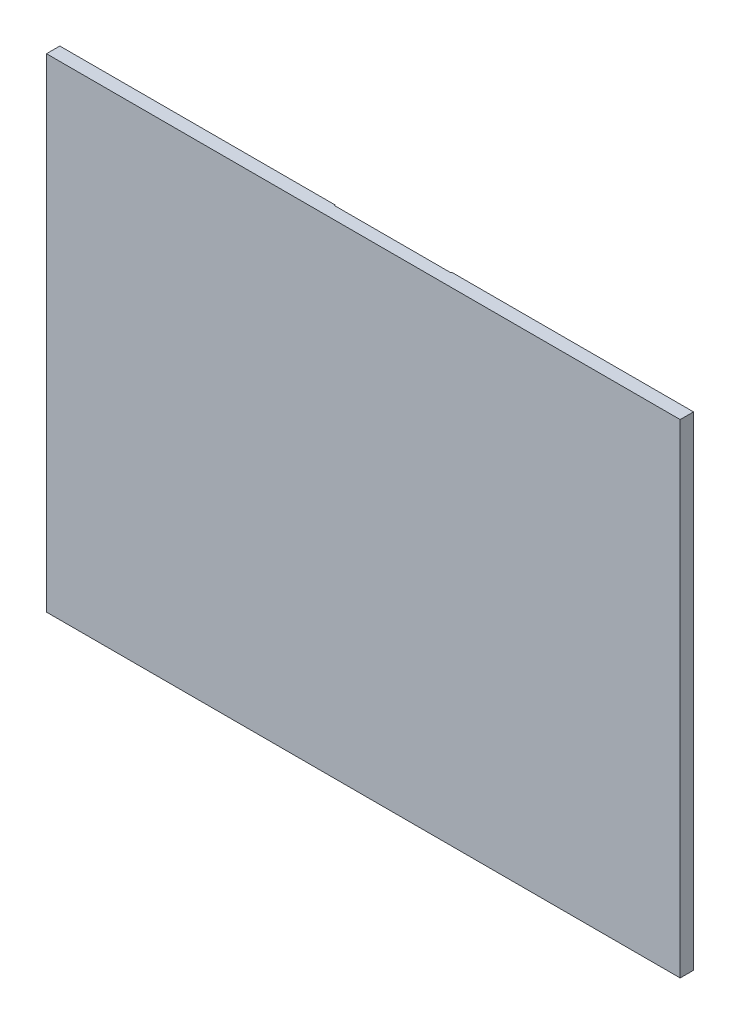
ISO-10303-21;
HEADER;
FILE_DESCRIPTION(('STEP AP214'),'2;1');
FILE_NAME('part.step','',(''),(''),'','','');
FILE_SCHEMA(('AUTOMOTIVE_DESIGN { 1 0 10303 214 1 1 1 1 }'));
ENDSEC;
DATA;
#1=APPLICATION_CONTEXT('core data for automotive mechanical design processes');
#2=APPLICATION_PROTOCOL_DEFINITION('international standard','automotive_design',2000,#1);
#3=PRODUCT_CONTEXT('',#1,'mechanical');
#4=PRODUCT('Part','Part','',(#3));
#5=PRODUCT_RELATED_PRODUCT_CATEGORY('part','',(#4));
#6=PRODUCT_DEFINITION_FORMATION('','',#4);
#7=PRODUCT_DEFINITION_CONTEXT('part definition',#1,'design');
#8=PRODUCT_DEFINITION('design','',#6,#7);
#9=PRODUCT_DEFINITION_SHAPE('','',#8);
#10=(LENGTH_UNIT() NAMED_UNIT(*) SI_UNIT(.MILLI.,.METRE.));
#11=(NAMED_UNIT(*) PLANE_ANGLE_UNIT() SI_UNIT($,.RADIAN.));
#12=(NAMED_UNIT(*) SI_UNIT($,.STERADIAN.) SOLID_ANGLE_UNIT());
#13=UNCERTAINTY_MEASURE_WITH_UNIT(LENGTH_MEASURE(1.E-05),#10,'distance_accuracy_value','');
#14=(GEOMETRIC_REPRESENTATION_CONTEXT(3) GLOBAL_UNCERTAINTY_ASSIGNED_CONTEXT((#13)) GLOBAL_UNIT_ASSIGNED_CONTEXT((#10,
#11,#12)) REPRESENTATION_CONTEXT('',''));
#15=CARTESIAN_POINT('',(0.,0.,0.));
#16=DIRECTION('',(0.,0.,1.));
#17=DIRECTION('',(1.,0.,0.));
#18=AXIS2_PLACEMENT_3D('',#15,#16,#17);
#19=CARTESIAN_POINT('',(-18.5,29.,0.));
#20=DIRECTION('',(0.,0.,-1.));
#21=DIRECTION('',(-1.,0.,0.));
#22=AXIS2_PLACEMENT_3D('',#19,#20,#21);
#23=PLANE('',#22);
#24=DIRECTION('',(0.,1.,0.));
#25=VECTOR('',#24,1.);
#26=CARTESIAN_POINT('',(14.5,29.,0.));
#27=LINE('',#26,#25);
#28=CARTESIAN_POINT('',(14.5,-29.,0.));
#29=VERTEX_POINT('',#28);
#30=CARTESIAN_POINT('',(14.5,29.,0.));
#31=VERTEX_POINT('',#30);
#32=EDGE_CURVE('E40',#29,#31,#27,.T.);
#33=ORIENTED_EDGE('',*,*,#32,.F.);
#34=DIRECTION('',(1.,0.,0.));
#35=VECTOR('',#34,1.);
#36=CARTESIAN_POINT('',(-18.5,-29.,0.));
#37=LINE('',#36,#35);
#38=CARTESIAN_POINT('',(-18.5,-29.,0.));
#39=VERTEX_POINT('',#38);
#40=EDGE_CURVE('E119',#39,#29,#37,.T.);
#41=ORIENTED_EDGE('',*,*,#40,.F.);
#42=DIRECTION('',(0.,-1.,0.));
#43=VECTOR('',#42,1.);
#44=CARTESIAN_POINT('',(-18.5,29.,0.));
#45=LINE('',#44,#43);
#46=CARTESIAN_POINT('',(-18.5,29.,0.));
#47=VERTEX_POINT('',#46);
#48=EDGE_CURVE('E120',#47,#39,#45,.T.);
#49=ORIENTED_EDGE('',*,*,#48,.F.);
#50=DIRECTION('',(-1.,0.,0.));
#51=VECTOR('',#50,1.);
#52=CARTESIAN_POINT('',(-18.5,29.,0.));
#53=LINE('',#52,#51);
#54=EDGE_CURVE('E157',#31,#47,#53,.T.);
#55=ORIENTED_EDGE('',*,*,#54,.F.);
#56=EDGE_LOOP('',(#33,#41,#49,#55));
#57=FACE_BOUND('',#56,.T.);
#58=ADVANCED_FACE('F32',(#57),#23,.T.);
#59=CARTESIAN_POINT('',(-18.5,29.,1.6));
#60=DIRECTION('',(0.,-1.,0.));
#61=DIRECTION('',(1.,0.,0.));
#62=AXIS2_PLACEMENT_3D('',#59,#60,#61);
#63=PLANE('',#62);
#64=DIRECTION('',(-1.,0.,0.));
#65=VECTOR('',#64,1.);
#66=CARTESIAN_POINT('',(-18.5,29.,0.1));
#67=LINE('',#66,#65);
#68=CARTESIAN_POINT('',(28.5,29.,0.1));
#69=VERTEX_POINT('',#68);
#70=CARTESIAN_POINT('',(14.5,29.,0.1));
#71=VERTEX_POINT('',#70);
#72=EDGE_CURVE('E159',#69,#71,#67,.T.);
#73=ORIENTED_EDGE('',*,*,#72,.T.);
#74=DIRECTION('',(0.,0.,-1.));
#75=VECTOR('',#74,1.);
#76=CARTESIAN_POINT('',(14.5,29.,1.6));
#77=LINE('',#76,#75);
#78=EDGE_CURVE('E148',#71,#31,#77,.T.);
#79=ORIENTED_EDGE('',*,*,#78,.T.);
#80=ORIENTED_EDGE('',*,*,#54,.T.);
#81=DIRECTION('',(0.,0.,-1.));
#82=VECTOR('',#81,1.);
#83=CARTESIAN_POINT('',(-18.5,29.,1.6));
#84=LINE('',#83,#82);
#85=CARTESIAN_POINT('',(-18.5,29.,1.6));
#86=VERTEX_POINT('',#85);
#87=EDGE_CURVE('E105',#86,#47,#84,.T.);
#88=ORIENTED_EDGE('',*,*,#87,.F.);
#89=DIRECTION('',(-1.,0.,0.));
#90=VECTOR('',#89,1.);
#91=CARTESIAN_POINT('',(-18.5,29.,1.6));
#92=LINE('',#91,#90);
#93=CARTESIAN_POINT('',(57.5,29.,1.6));
#94=VERTEX_POINT('',#93);
#95=EDGE_CURVE('E127',#94,#86,#92,.T.);
#96=ORIENTED_EDGE('',*,*,#95,.F.);
#97=DIRECTION('',(0.,0.,-1.));
#98=VECTOR('',#97,1.);
#99=CARTESIAN_POINT('',(57.5,29.,1.6));
#100=LINE('',#99,#98);
#101=CARTESIAN_POINT('',(57.5,29.,0.));
#102=VERTEX_POINT('',#101);
#103=EDGE_CURVE('E134',#94,#102,#100,.T.);
#104=ORIENTED_EDGE('',*,*,#103,.T.);
#105=CARTESIAN_POINT('',(28.5,29.,0.));
#106=VERTEX_POINT('',#105);
#107=EDGE_CURVE('E122',#102,#106,#53,.T.);
#108=ORIENTED_EDGE('',*,*,#107,.T.);
#109=DIRECTION('',(0.,0.,1.));
#110=VECTOR('',#109,1.);
#111=CARTESIAN_POINT('',(28.5,29.,1.6));
#112=LINE('',#111,#110);
#113=EDGE_CURVE('E47',#106,#69,#112,.T.);
#114=ORIENTED_EDGE('',*,*,#113,.T.);
#115=EDGE_LOOP('',(#73,#79,#80,#88,#96,#104,#108,#114));
#116=FACE_BOUND('',#115,.T.);
#117=ADVANCED_FACE('F34',(#116),#63,.F.);
#118=CARTESIAN_POINT('',(-18.5,29.,1.6));
#119=DIRECTION('',(1.,0.,0.));
#120=DIRECTION('',(0.,1.,0.));
#121=AXIS2_PLACEMENT_3D('',#118,#119,#120);
#122=PLANE('',#121);
#123=ORIENTED_EDGE('',*,*,#48,.T.);
#124=DIRECTION('',(0.,0.,-1.));
#125=VECTOR('',#124,1.);
#126=CARTESIAN_POINT('',(-18.5,-29.,1.6));
#127=LINE('',#126,#125);
#128=CARTESIAN_POINT('',(-18.5,-29.,1.6));
#129=VERTEX_POINT('',#128);
#130=EDGE_CURVE('E139',#129,#39,#127,.T.);
#131=ORIENTED_EDGE('',*,*,#130,.F.);
#132=DIRECTION('',(0.,-1.,0.));
#133=VECTOR('',#132,1.);
#134=CARTESIAN_POINT('',(-18.5,29.,1.6));
#135=LINE('',#134,#133);
#136=EDGE_CURVE('E129',#86,#129,#135,.T.);
#137=ORIENTED_EDGE('',*,*,#136,.F.);
#138=ORIENTED_EDGE('',*,*,#87,.T.);
#139=EDGE_LOOP('',(#123,#131,#137,#138));
#140=FACE_BOUND('',#139,.T.);
#141=ADVANCED_FACE('F176',(#140),#122,.F.);
#142=CARTESIAN_POINT('',(-18.5,-29.,1.6));
#143=DIRECTION('',(0.,1.,0.));
#144=DIRECTION('',(-1.,0.,0.));
#145=AXIS2_PLACEMENT_3D('',#142,#143,#144);
#146=PLANE('',#145);
#147=ORIENTED_EDGE('',*,*,#40,.T.);
#148=DIRECTION('',(0.,0.,1.));
#149=VECTOR('',#148,1.);
#150=CARTESIAN_POINT('',(14.5,-29.,1.6));
#151=LINE('',#150,#149);
#152=CARTESIAN_POINT('',(14.5,-29.,0.1));
#153=VERTEX_POINT('',#152);
#154=EDGE_CURVE('E150',#29,#153,#151,.T.);
#155=ORIENTED_EDGE('',*,*,#154,.T.);
#156=DIRECTION('',(1.,0.,0.));
#157=VECTOR('',#156,1.);
#158=CARTESIAN_POINT('',(-18.5,-29.,0.1));
#159=LINE('',#158,#157);
#160=CARTESIAN_POINT('',(28.5,-29.,0.1));
#161=VERTEX_POINT('',#160);
#162=EDGE_CURVE('E11',#153,#161,#159,.T.);
#163=ORIENTED_EDGE('',*,*,#162,.T.);
#164=DIRECTION('',(0.,0.,-1.));
#165=VECTOR('',#164,1.);
#166=CARTESIAN_POINT('',(28.5,-29.,1.6));
#167=LINE('',#166,#165);
#168=CARTESIAN_POINT('',(28.5,-29.,0.));
#169=VERTEX_POINT('',#168);
#170=EDGE_CURVE('E99',#161,#169,#167,.T.);
#171=ORIENTED_EDGE('',*,*,#170,.T.);
#172=CARTESIAN_POINT('',(57.5,-29.,0.));
#173=VERTEX_POINT('',#172);
#174=EDGE_CURVE('E111',#169,#173,#37,.T.);
#175=ORIENTED_EDGE('',*,*,#174,.T.);
#176=DIRECTION('',(0.,0.,-1.));
#177=VECTOR('',#176,1.);
#178=CARTESIAN_POINT('',(57.5,-29.,1.6));
#179=LINE('',#178,#177);
#180=CARTESIAN_POINT('',(57.5,-29.,1.6));
#181=VERTEX_POINT('',#180);
#182=EDGE_CURVE('E137',#181,#173,#179,.T.);
#183=ORIENTED_EDGE('',*,*,#182,.F.);
#184=DIRECTION('',(1.,0.,0.));
#185=VECTOR('',#184,1.);
#186=CARTESIAN_POINT('',(-18.5,-29.,1.6));
#187=LINE('',#186,#185);
#188=EDGE_CURVE('E131',#129,#181,#187,.T.);
#189=ORIENTED_EDGE('',*,*,#188,.F.);
#190=ORIENTED_EDGE('',*,*,#130,.T.);
#191=EDGE_LOOP('',(#147,#155,#163,#171,#175,#183,#189,#190));
#192=FACE_BOUND('',#191,.T.);
#193=ADVANCED_FACE('F109',(#192),#146,.F.);
#194=CARTESIAN_POINT('',(57.5,29.,1.6));
#195=DIRECTION('',(-1.,0.,0.));
#196=DIRECTION('',(0.,-1.,0.));
#197=AXIS2_PLACEMENT_3D('',#194,#195,#196);
#198=PLANE('',#197);
#199=DIRECTION('',(0.,1.,0.));
#200=VECTOR('',#199,1.);
#201=CARTESIAN_POINT('',(57.5,29.,0.));
#202=LINE('',#201,#200);
#203=EDGE_CURVE('E118',#173,#102,#202,.T.);
#204=ORIENTED_EDGE('',*,*,#203,.T.);
#205=ORIENTED_EDGE('',*,*,#103,.F.);
#206=DIRECTION('',(0.,1.,0.));
#207=VECTOR('',#206,1.);
#208=CARTESIAN_POINT('',(57.5,29.,1.6));
#209=LINE('',#208,#207);
#210=EDGE_CURVE('E55',#181,#94,#209,.T.);
#211=ORIENTED_EDGE('',*,*,#210,.F.);
#212=ORIENTED_EDGE('',*,*,#182,.T.);
#213=EDGE_LOOP('',(#204,#205,#211,#212));
#214=FACE_BOUND('',#213,.T.);
#215=ADVANCED_FACE('F171',(#214),#198,.F.);
#216=CARTESIAN_POINT('',(-18.5,29.,1.6));
#217=DIRECTION('',(0.,0.,-1.));
#218=DIRECTION('',(-1.,0.,0.));
#219=AXIS2_PLACEMENT_3D('',#216,#217,#218);
#220=PLANE('',#219);
#221=ORIENTED_EDGE('',*,*,#95,.T.);
#222=ORIENTED_EDGE('',*,*,#136,.T.);
#223=ORIENTED_EDGE('',*,*,#188,.T.);
#224=ORIENTED_EDGE('',*,*,#210,.T.);
#225=EDGE_LOOP('',(#221,#222,#223,#224));
#226=FACE_BOUND('',#225,.T.);
#227=ADVANCED_FACE('F174',(#226),#220,.F.);
#228=DIRECTION('',(0.,-1.,0.));
#229=VECTOR('',#228,1.);
#230=CARTESIAN_POINT('',(28.5,29.,0.));
#231=LINE('',#230,#229);
#232=EDGE_CURVE('E96',#106,#169,#231,.T.);
#233=ORIENTED_EDGE('',*,*,#232,.F.);
#234=ORIENTED_EDGE('',*,*,#107,.F.);
#235=ORIENTED_EDGE('',*,*,#203,.F.);
#236=ORIENTED_EDGE('',*,*,#174,.F.);
#237=EDGE_LOOP('',(#233,#234,#235,#236));
#238=FACE_BOUND('',#237,.T.);
#239=ADVANCED_FACE('F117',(#238),#23,.T.);
#240=CARTESIAN_POINT('',(14.5,31.6865626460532,0.1));
#241=DIRECTION('',(0.,0.,1.));
#242=DIRECTION('',(1.,0.,0.));
#243=AXIS2_PLACEMENT_3D('',#240,#241,#242);
#244=PLANE('',#243);
#245=DIRECTION('',(0.,-1.,0.));
#246=VECTOR('',#245,1.);
#247=CARTESIAN_POINT('',(28.5,31.6865626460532,0.1));
#248=LINE('',#247,#246);
#249=EDGE_CURVE('E166',#69,#161,#248,.T.);
#250=ORIENTED_EDGE('',*,*,#249,.T.);
#251=ORIENTED_EDGE('',*,*,#162,.F.);
#252=DIRECTION('',(0.,1.,0.));
#253=VECTOR('',#252,1.);
#254=CARTESIAN_POINT('',(14.5,31.6865626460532,0.1));
#255=LINE('',#254,#253);
#256=EDGE_CURVE('E114',#153,#71,#255,.T.);
#257=ORIENTED_EDGE('',*,*,#256,.T.);
#258=ORIENTED_EDGE('',*,*,#72,.F.);
#259=EDGE_LOOP('',(#250,#251,#257,#258));
#260=FACE_BOUND('',#259,.T.);
#261=ADVANCED_FACE('F168',(#260),#244,.F.);
#262=CARTESIAN_POINT('',(14.5,31.6865626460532,0.1));
#263=DIRECTION('',(-1.,0.,0.));
#264=DIRECTION('',(0.,-1.,0.));
#265=AXIS2_PLACEMENT_3D('',#262,#263,#264);
#266=PLANE('',#265);
#267=ORIENTED_EDGE('',*,*,#256,.F.);
#268=ORIENTED_EDGE('',*,*,#154,.F.);
#269=ORIENTED_EDGE('',*,*,#32,.T.);
#270=ORIENTED_EDGE('',*,*,#78,.F.);
#271=EDGE_LOOP('',(#267,#268,#269,#270));
#272=FACE_BOUND('',#271,.T.);
#273=ADVANCED_FACE('F147',(#272),#266,.F.);
#274=CARTESIAN_POINT('',(28.5,31.6865626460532,0.1));
#275=DIRECTION('',(1.,0.,0.));
#276=DIRECTION('',(0.,1.,0.));
#277=AXIS2_PLACEMENT_3D('',#274,#275,#276);
#278=PLANE('',#277);
#279=ORIENTED_EDGE('',*,*,#232,.T.);
#280=ORIENTED_EDGE('',*,*,#170,.F.);
#281=ORIENTED_EDGE('',*,*,#249,.F.);
#282=ORIENTED_EDGE('',*,*,#113,.F.);
#283=EDGE_LOOP('',(#279,#280,#281,#282));
#284=FACE_BOUND('',#283,.T.);
#285=ADVANCED_FACE('F98',(#284),#278,.F.);
#286=CLOSED_SHELL('',(#58,#117,#141,#193,#215,#227,#239,#261,#273,#285));
#287=MANIFOLD_SOLID_BREP('B2',#286);
#288=ADVANCED_BREP_SHAPE_REPRESENTATION('',(#18,#287),#14);
#289=SHAPE_DEFINITION_REPRESENTATION(#9,#288);
ENDSEC;
END-ISO-10303-21;
